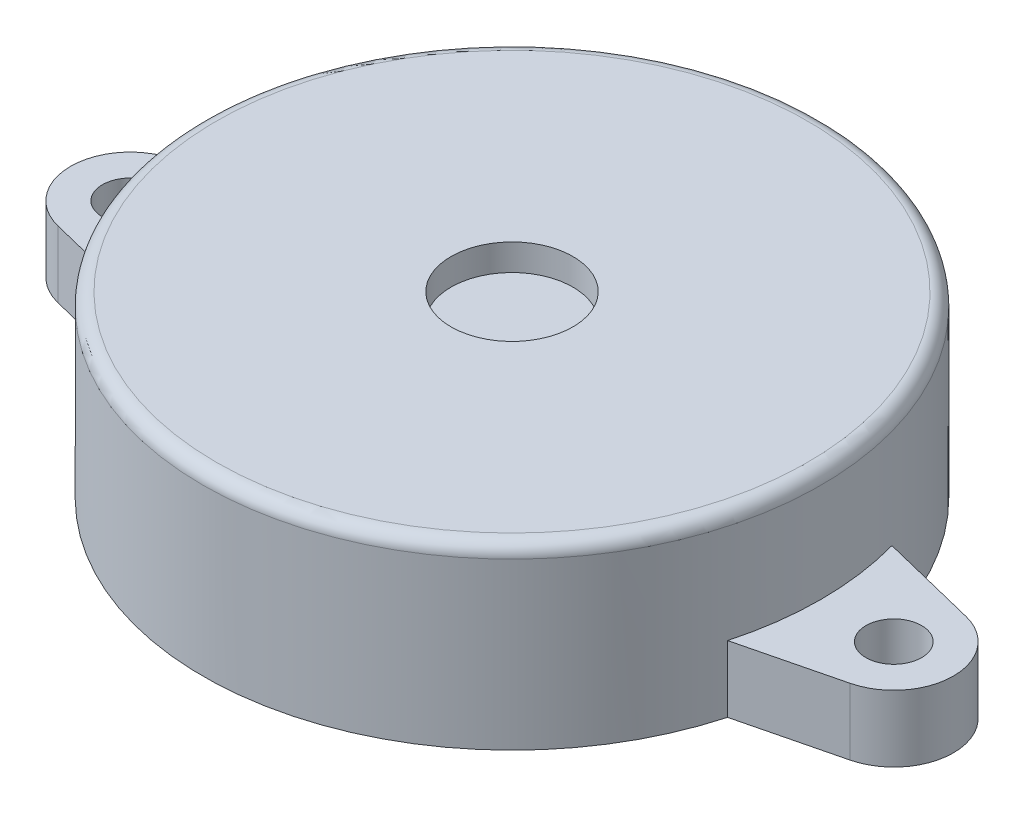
ISO-10303-21;
HEADER;
FILE_DESCRIPTION(('STEP AP214'),'2;1');
FILE_NAME('part.step','',(''),(''),'','','');
FILE_SCHEMA(('AUTOMOTIVE_DESIGN { 1 0 10303 214 1 1 1 1 }'));
ENDSEC;
DATA;
#1=APPLICATION_CONTEXT('core data for automotive mechanical design processes');
#2=APPLICATION_PROTOCOL_DEFINITION('international standard','automotive_design',2000,#1);
#3=PRODUCT_CONTEXT('',#1,'mechanical');
#4=PRODUCT('Part','Part','',(#3));
#5=PRODUCT_RELATED_PRODUCT_CATEGORY('part','',(#4));
#6=PRODUCT_DEFINITION_FORMATION('','',#4);
#7=PRODUCT_DEFINITION_CONTEXT('part definition',#1,'design');
#8=PRODUCT_DEFINITION('design','',#6,#7);
#9=PRODUCT_DEFINITION_SHAPE('','',#8);
#10=(LENGTH_UNIT() NAMED_UNIT(*) SI_UNIT(.MILLI.,.METRE.));
#11=(NAMED_UNIT(*) PLANE_ANGLE_UNIT() SI_UNIT($,.RADIAN.));
#12=(NAMED_UNIT(*) SI_UNIT($,.STERADIAN.) SOLID_ANGLE_UNIT());
#13=UNCERTAINTY_MEASURE_WITH_UNIT(LENGTH_MEASURE(1.E-05),#10,'distance_accuracy_value','');
#14=(GEOMETRIC_REPRESENTATION_CONTEXT(3) GLOBAL_UNCERTAINTY_ASSIGNED_CONTEXT((#13)) GLOBAL_UNIT_ASSIGNED_CONTEXT((#10,
#11,#12)) REPRESENTATION_CONTEXT('',''));
#15=CARTESIAN_POINT('',(0.,0.,0.));
#16=DIRECTION('',(0.,0.,1.));
#17=DIRECTION('',(1.,0.,0.));
#18=AXIS2_PLACEMENT_3D('',#15,#16,#17);
#19=CARTESIAN_POINT('',(0.,4.23,0.));
#20=DIRECTION('',(0.,-1.,0.));
#21=DIRECTION('',(0.,0.,-1.));
#22=AXIS2_PLACEMENT_3D('',#19,#20,#21);
#23=CYLINDRICAL_SURFACE('',#22,11.65);
#24=CARTESIAN_POINT('',(0.,3.73,0.));
#25=DIRECTION('',(0.,1.,0.));
#26=DIRECTION('',(0.,0.,1.));
#27=AXIS2_PLACEMENT_3D('',#24,#25,#26);
#28=CIRCLE('',#27,11.65);
#29=CARTESIAN_POINT('',(0.,3.73,11.65));
#30=VERTEX_POINT('',#29);
#31=EDGE_CURVE('E11',#30,#30,#28,.F.);
#32=ORIENTED_EDGE('',*,*,#31,.T.);
#33=EDGE_LOOP('',(#32));
#34=FACE_BOUND('',#33,.T.);
#35=CARTESIAN_POINT('',(0.,0.,0.));
#36=DIRECTION('',(0.,1.,0.));
#37=DIRECTION('',(0.,0.,1.));
#38=AXIS2_PLACEMENT_3D('',#35,#36,#37);
#39=CIRCLE('',#38,11.65);
#40=CARTESIAN_POINT('',(11.2299821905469,0.,3.1));
#41=VERTEX_POINT('',#40);
#42=CARTESIAN_POINT('',(11.2299821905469,0.,-3.1));
#43=VERTEX_POINT('',#42);
#44=EDGE_CURVE('E153',#41,#43,#39,.T.);
#45=ORIENTED_EDGE('',*,*,#44,.T.);
#46=DIRECTION('',(0.,1.,0.));
#47=VECTOR('',#46,1.);
#48=CARTESIAN_POINT('',(11.2299821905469,-2.51,-3.1));
#49=LINE('',#48,#47);
#50=CARTESIAN_POINT('',(11.2299821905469,-2.51,-3.1));
#51=VERTEX_POINT('',#50);
#52=EDGE_CURVE('E152',#51,#43,#49,.T.);
#53=ORIENTED_EDGE('',*,*,#52,.F.);
#54=CARTESIAN_POINT('',(0.,-2.51,0.));
#55=DIRECTION('',(0.,-1.,0.));
#56=DIRECTION('',(0.,0.,-1.));
#57=AXIS2_PLACEMENT_3D('',#54,#55,#56);
#58=CIRCLE('',#57,11.65);
#59=CARTESIAN_POINT('',(-11.2299821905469,-2.51,-3.1));
#60=VERTEX_POINT('',#59);
#61=EDGE_CURVE('E172',#60,#51,#58,.T.);
#62=ORIENTED_EDGE('',*,*,#61,.F.);
#63=DIRECTION('',(0.,1.,0.));
#64=VECTOR('',#63,1.);
#65=CARTESIAN_POINT('',(-11.2299821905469,-2.51,-3.1));
#66=LINE('',#65,#64);
#67=CARTESIAN_POINT('',(-11.2299821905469,0.,-3.1));
#68=VERTEX_POINT('',#67);
#69=EDGE_CURVE('E134',#60,#68,#66,.T.);
#70=ORIENTED_EDGE('',*,*,#69,.T.);
#71=CARTESIAN_POINT('',(-11.2299821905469,0.,3.1));
#72=VERTEX_POINT('',#71);
#73=EDGE_CURVE('E89',#68,#72,#39,.T.);
#74=ORIENTED_EDGE('',*,*,#73,.T.);
#75=DIRECTION('',(0.,1.,0.));
#76=VECTOR('',#75,1.);
#77=CARTESIAN_POINT('',(-11.2299821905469,-2.51,3.1));
#78=LINE('',#77,#76);
#79=CARTESIAN_POINT('',(-11.2299821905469,-2.51,3.1));
#80=VERTEX_POINT('',#79);
#81=EDGE_CURVE('E128',#80,#72,#78,.T.);
#82=ORIENTED_EDGE('',*,*,#81,.F.);
#83=CARTESIAN_POINT('',(0.,-2.51,0.));
#84=DIRECTION('',(0.,-1.,0.));
#85=DIRECTION('',(0.,0.,-1.));
#86=AXIS2_PLACEMENT_3D('',#83,#84,#85);
#87=CIRCLE('',#86,11.65);
#88=CARTESIAN_POINT('',(11.2299821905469,-2.51,3.1));
#89=VERTEX_POINT('',#88);
#90=EDGE_CURVE('E118',#89,#80,#87,.T.);
#91=ORIENTED_EDGE('',*,*,#90,.F.);
#92=DIRECTION('',(0.,1.,0.));
#93=VECTOR('',#92,1.);
#94=CARTESIAN_POINT('',(11.2299821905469,-2.51,3.1));
#95=LINE('',#94,#93);
#96=EDGE_CURVE('E50',#89,#41,#95,.T.);
#97=ORIENTED_EDGE('',*,*,#96,.T.);
#98=EDGE_LOOP('',(#45,#53,#62,#70,#74,#82,#91,#97));
#99=FACE_BOUND('',#98,.T.);
#100=ADVANCED_FACE('F35',(#34,#99),#23,.T.);
#101=CARTESIAN_POINT('',(0.,4.23,0.));
#102=DIRECTION('',(0.,1.,0.));
#103=DIRECTION('',(0.,0.,1.));
#104=AXIS2_PLACEMENT_3D('',#101,#102,#103);
#105=PLANE('',#104);
#106=CARTESIAN_POINT('',(0.,4.23,0.));
#107=DIRECTION('',(0.,1.,0.));
#108=DIRECTION('',(0.,0.,1.));
#109=AXIS2_PLACEMENT_3D('',#106,#107,#108);
#110=CIRCLE('',#109,11.15);
#111=CARTESIAN_POINT('',(0.,4.23,11.15));
#112=VERTEX_POINT('',#111);
#113=EDGE_CURVE('E43',#112,#112,#110,.T.);
#114=ORIENTED_EDGE('',*,*,#113,.T.);
#115=EDGE_LOOP('',(#114));
#116=FACE_BOUND('',#115,.T.);
#117=CARTESIAN_POINT('',(0.,4.23,0.));
#118=DIRECTION('',(0.,1.,0.));
#119=DIRECTION('',(0.,0.,1.));
#120=AXIS2_PLACEMENT_3D('',#117,#118,#119);
#121=CIRCLE('',#120,2.3);
#122=CARTESIAN_POINT('',(0.,4.23,2.3));
#123=VERTEX_POINT('',#122);
#124=EDGE_CURVE('E252',#123,#123,#121,.T.);
#125=ORIENTED_EDGE('',*,*,#124,.F.);
#126=EDGE_LOOP('',(#125));
#127=FACE_BOUND('',#126,.T.);
#128=ADVANCED_FACE('F188',(#116,#127),#105,.T.);
#129=CARTESIAN_POINT('',(0.,0.,0.));
#130=DIRECTION('',(0.,-1.,0.));
#131=DIRECTION('',(0.,0.,-1.));
#132=AXIS2_PLACEMENT_3D('',#129,#130,#131);
#133=PLANE('',#132);
#134=ORIENTED_EDGE('',*,*,#44,.F.);
#135=DIRECTION('',(-0.970861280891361,0.,0.239642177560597));
#136=VECTOR('',#135,1.);
#137=CARTESIAN_POINT('',(11.2299821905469,0.,3.1));
#138=LINE('',#137,#136);
#139=CARTESIAN_POINT('',(14.9391948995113,0.,2.18443788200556));
#140=VERTEX_POINT('',#139);
#141=EDGE_CURVE('E140',#140,#41,#138,.T.);
#142=ORIENTED_EDGE('',*,*,#141,.F.);
#143=CARTESIAN_POINT('',(14.4,0.,0.));
#144=DIRECTION('',(0.,-1.,0.));
#145=DIRECTION('',(0.,0.,-1.));
#146=AXIS2_PLACEMENT_3D('',#143,#144,#145);
#147=CIRCLE('',#146,2.25);
#148=CARTESIAN_POINT('',(14.9391948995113,0.,-2.18443788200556));
#149=VERTEX_POINT('',#148);
#150=EDGE_CURVE('E138',#149,#140,#147,.T.);
#151=ORIENTED_EDGE('',*,*,#150,.F.);
#152=DIRECTION('',(0.970861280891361,0.,0.239642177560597));
#153=VECTOR('',#152,1.);
#154=CARTESIAN_POINT('',(11.2299821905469,0.,-3.1));
#155=LINE('',#154,#153);
#156=EDGE_CURVE('E141',#43,#149,#155,.T.);
#157=ORIENTED_EDGE('',*,*,#156,.F.);
#158=EDGE_LOOP('',(#134,#142,#151,#157));
#159=FACE_BOUND('',#158,.T.);
#160=CARTESIAN_POINT('',(14.4,0.,0.));
#161=DIRECTION('',(0.,-1.,0.));
#162=DIRECTION('',(0.,0.,-1.));
#163=AXIS2_PLACEMENT_3D('',#160,#161,#162);
#164=CIRCLE('',#163,1.05);
#165=CARTESIAN_POINT('',(14.4,0.,-1.05));
#166=VERTEX_POINT('',#165);
#167=EDGE_CURVE('E260',#166,#166,#164,.T.);
#168=ORIENTED_EDGE('',*,*,#167,.T.);
#169=EDGE_LOOP('',(#168));
#170=FACE_BOUND('',#169,.T.);
#171=ADVANCED_FACE('F206',(#159,#170),#133,.F.);
#172=CARTESIAN_POINT('',(0.,-2.51,0.));
#173=DIRECTION('',(0.,-1.,0.));
#174=DIRECTION('',(0.,0.,-1.));
#175=AXIS2_PLACEMENT_3D('',#172,#173,#174);
#176=PLANE('',#175);
#177=CARTESIAN_POINT('',(14.4,-2.51,0.));
#178=DIRECTION('',(0.,-1.,0.));
#179=DIRECTION('',(0.,0.,-1.));
#180=AXIS2_PLACEMENT_3D('',#177,#178,#179);
#181=CIRCLE('',#180,1.05);
#182=CARTESIAN_POINT('',(14.4,-2.51,-1.05));
#183=VERTEX_POINT('',#182);
#184=EDGE_CURVE('E180',#183,#183,#181,.T.);
#185=ORIENTED_EDGE('',*,*,#184,.F.);
#186=EDGE_LOOP('',(#185));
#187=FACE_BOUND('',#186,.T.);
#188=ORIENTED_EDGE('',*,*,#61,.T.);
#189=DIRECTION('',(0.970861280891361,0.,0.239642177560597));
#190=VECTOR('',#189,1.);
#191=CARTESIAN_POINT('',(11.2299821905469,-2.51,-3.1));
#192=LINE('',#191,#190);
#193=CARTESIAN_POINT('',(14.9391948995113,-2.51,-2.18443788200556));
#194=VERTEX_POINT('',#193);
#195=EDGE_CURVE('E98',#51,#194,#192,.T.);
#196=ORIENTED_EDGE('',*,*,#195,.T.);
#197=CARTESIAN_POINT('',(14.4,-2.51,0.));
#198=DIRECTION('',(0.,-1.,0.));
#199=DIRECTION('',(0.,0.,-1.));
#200=AXIS2_PLACEMENT_3D('',#197,#198,#199);
#201=CIRCLE('',#200,2.25);
#202=CARTESIAN_POINT('',(14.9391948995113,-2.51,2.18443788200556));
#203=VERTEX_POINT('',#202);
#204=EDGE_CURVE('E269',#194,#203,#201,.T.);
#205=ORIENTED_EDGE('',*,*,#204,.T.);
#206=DIRECTION('',(-0.970861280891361,0.,0.239642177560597));
#207=VECTOR('',#206,1.);
#208=CARTESIAN_POINT('',(11.2299821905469,-2.51,3.1));
#209=LINE('',#208,#207);
#210=EDGE_CURVE('E271',#203,#89,#209,.T.);
#211=ORIENTED_EDGE('',*,*,#210,.T.);
#212=ORIENTED_EDGE('',*,*,#90,.T.);
#213=DIRECTION('',(-0.970861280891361,0.,-0.239642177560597));
#214=VECTOR('',#213,1.);
#215=CARTESIAN_POINT('',(-11.2299821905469,-2.51,3.1));
#216=LINE('',#215,#214);
#217=CARTESIAN_POINT('',(-14.9391948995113,-2.51,2.18443788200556));
#218=VERTEX_POINT('',#217);
#219=EDGE_CURVE('E111',#80,#218,#216,.T.);
#220=ORIENTED_EDGE('',*,*,#219,.T.);
#221=CARTESIAN_POINT('',(-14.4,-2.51,0.));
#222=DIRECTION('',(0.,-1.,0.));
#223=DIRECTION('',(0.,0.,1.));
#224=AXIS2_PLACEMENT_3D('',#221,#222,#223);
#225=CIRCLE('',#224,2.25);
#226=CARTESIAN_POINT('',(-14.9391948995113,-2.51,-2.18443788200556));
#227=VERTEX_POINT('',#226);
#228=EDGE_CURVE('E116',#218,#227,#225,.T.);
#229=ORIENTED_EDGE('',*,*,#228,.T.);
#230=DIRECTION('',(0.970861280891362,0.,-0.239642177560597));
#231=VECTOR('',#230,1.);
#232=CARTESIAN_POINT('',(-11.2299821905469,-2.51,-3.1));
#233=LINE('',#232,#231);
#234=EDGE_CURVE('E59',#227,#60,#233,.T.);
#235=ORIENTED_EDGE('',*,*,#234,.T.);
#236=EDGE_LOOP('',(#188,#196,#205,#211,#212,#220,#229,#235));
#237=FACE_BOUND('',#236,.T.);
#238=CARTESIAN_POINT('',(-14.4,-2.51,0.));
#239=DIRECTION('',(0.,-1.,0.));
#240=DIRECTION('',(0.,0.,1.));
#241=AXIS2_PLACEMENT_3D('',#238,#239,#240);
#242=CIRCLE('',#241,1.05);
#243=CARTESIAN_POINT('',(-14.4,-2.51,1.05));
#244=VERTEX_POINT('',#243);
#245=EDGE_CURVE('E257',#244,#244,#242,.T.);
#246=ORIENTED_EDGE('',*,*,#245,.F.);
#247=EDGE_LOOP('',(#246));
#248=FACE_BOUND('',#247,.T.);
#249=ADVANCED_FACE('F113',(#187,#237,#248),#176,.T.);
#250=ORIENTED_EDGE('',*,*,#73,.F.);
#251=DIRECTION('',(0.970861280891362,0.,-0.239642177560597));
#252=VECTOR('',#251,1.);
#253=CARTESIAN_POINT('',(-11.2299821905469,0.,-3.1));
#254=LINE('',#253,#252);
#255=CARTESIAN_POINT('',(-14.9391948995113,0.,-2.18443788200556));
#256=VERTEX_POINT('',#255);
#257=EDGE_CURVE('E144',#256,#68,#254,.T.);
#258=ORIENTED_EDGE('',*,*,#257,.F.);
#259=CARTESIAN_POINT('',(-14.4,0.,0.));
#260=DIRECTION('',(0.,-1.,0.));
#261=DIRECTION('',(0.,0.,1.));
#262=AXIS2_PLACEMENT_3D('',#259,#260,#261);
#263=CIRCLE('',#262,2.25);
#264=CARTESIAN_POINT('',(-14.9391948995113,0.,2.18443788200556));
#265=VERTEX_POINT('',#264);
#266=EDGE_CURVE('E142',#265,#256,#263,.T.);
#267=ORIENTED_EDGE('',*,*,#266,.F.);
#268=DIRECTION('',(-0.970861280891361,0.,-0.239642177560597));
#269=VECTOR('',#268,1.);
#270=CARTESIAN_POINT('',(-11.2299821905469,0.,3.1));
#271=LINE('',#270,#269);
#272=EDGE_CURVE('E125',#72,#265,#271,.T.);
#273=ORIENTED_EDGE('',*,*,#272,.F.);
#274=EDGE_LOOP('',(#250,#258,#267,#273));
#275=FACE_BOUND('',#274,.T.);
#276=CARTESIAN_POINT('',(-14.4,0.,0.));
#277=DIRECTION('',(0.,-1.,0.));
#278=DIRECTION('',(0.,0.,1.));
#279=AXIS2_PLACEMENT_3D('',#276,#277,#278);
#280=CIRCLE('',#279,1.05);
#281=CARTESIAN_POINT('',(-14.4,0.,1.05));
#282=VERTEX_POINT('',#281);
#283=EDGE_CURVE('E254',#282,#282,#280,.T.);
#284=ORIENTED_EDGE('',*,*,#283,.T.);
#285=EDGE_LOOP('',(#284));
#286=FACE_BOUND('',#285,.T.);
#287=ADVANCED_FACE('F213',(#275,#286),#133,.F.);
#288=CARTESIAN_POINT('',(11.2299821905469,-2.51,-3.1));
#289=DIRECTION('',(-0.239642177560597,0.,0.970861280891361));
#290=DIRECTION('',(0.970861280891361,0.,0.239642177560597));
#291=AXIS2_PLACEMENT_3D('',#288,#289,#290);
#292=PLANE('',#291);
#293=ORIENTED_EDGE('',*,*,#156,.T.);
#294=DIRECTION('',(0.,1.,0.));
#295=VECTOR('',#294,1.);
#296=CARTESIAN_POINT('',(14.9391948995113,-2.51,-2.18443788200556));
#297=LINE('',#296,#295);
#298=EDGE_CURVE('E149',#194,#149,#297,.T.);
#299=ORIENTED_EDGE('',*,*,#298,.F.);
#300=ORIENTED_EDGE('',*,*,#195,.F.);
#301=ORIENTED_EDGE('',*,*,#52,.T.);
#302=EDGE_LOOP('',(#293,#299,#300,#301));
#303=FACE_BOUND('',#302,.T.);
#304=ADVANCED_FACE('F209',(#303),#292,.F.);
#305=CARTESIAN_POINT('',(14.4,-2.51,0.));
#306=DIRECTION('',(0.,1.,0.));
#307=DIRECTION('',(0.,0.,1.));
#308=AXIS2_PLACEMENT_3D('',#305,#306,#307);
#309=CYLINDRICAL_SURFACE('',#308,2.25);
#310=ORIENTED_EDGE('',*,*,#150,.T.);
#311=DIRECTION('',(0.,1.,0.));
#312=VECTOR('',#311,1.);
#313=CARTESIAN_POINT('',(14.9391948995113,-2.51,2.18443788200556));
#314=LINE('',#313,#312);
#315=EDGE_CURVE('E146',#203,#140,#314,.T.);
#316=ORIENTED_EDGE('',*,*,#315,.F.);
#317=ORIENTED_EDGE('',*,*,#204,.F.);
#318=ORIENTED_EDGE('',*,*,#298,.T.);
#319=EDGE_LOOP('',(#310,#316,#317,#318));
#320=FACE_BOUND('',#319,.T.);
#321=ADVANCED_FACE('F212',(#320),#309,.T.);
#322=CARTESIAN_POINT('',(11.2299821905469,-2.51,3.1));
#323=DIRECTION('',(-0.239642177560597,0.,-0.970861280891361));
#324=DIRECTION('',(-0.970861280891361,0.,0.239642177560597));
#325=AXIS2_PLACEMENT_3D('',#322,#323,#324);
#326=PLANE('',#325);
#327=ORIENTED_EDGE('',*,*,#141,.T.);
#328=ORIENTED_EDGE('',*,*,#96,.F.);
#329=ORIENTED_EDGE('',*,*,#210,.F.);
#330=ORIENTED_EDGE('',*,*,#315,.T.);
#331=EDGE_LOOP('',(#327,#328,#329,#330));
#332=FACE_BOUND('',#331,.T.);
#333=ADVANCED_FACE('F216',(#332),#326,.F.);
#334=CARTESIAN_POINT('',(-11.2299821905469,-2.51,3.1));
#335=DIRECTION('',(0.239642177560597,0.,-0.970861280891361));
#336=DIRECTION('',(-0.970861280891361,0.,-0.239642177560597));
#337=AXIS2_PLACEMENT_3D('',#334,#335,#336);
#338=PLANE('',#337);
#339=ORIENTED_EDGE('',*,*,#272,.T.);
#340=DIRECTION('',(0.,1.,0.));
#341=VECTOR('',#340,1.);
#342=CARTESIAN_POINT('',(-14.9391948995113,-2.51,2.18443788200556));
#343=LINE('',#342,#341);
#344=EDGE_CURVE('E123',#218,#265,#343,.T.);
#345=ORIENTED_EDGE('',*,*,#344,.F.);
#346=ORIENTED_EDGE('',*,*,#219,.F.);
#347=ORIENTED_EDGE('',*,*,#81,.T.);
#348=EDGE_LOOP('',(#339,#345,#346,#347));
#349=FACE_BOUND('',#348,.T.);
#350=ADVANCED_FACE('F124',(#349),#338,.F.);
#351=CARTESIAN_POINT('',(-14.4,-2.51,0.));
#352=DIRECTION('',(0.,1.,0.));
#353=DIRECTION('',(0.,0.,1.));
#354=AXIS2_PLACEMENT_3D('',#351,#352,#353);
#355=CYLINDRICAL_SURFACE('',#354,2.25);
#356=ORIENTED_EDGE('',*,*,#266,.T.);
#357=DIRECTION('',(0.,1.,0.));
#358=VECTOR('',#357,1.);
#359=CARTESIAN_POINT('',(-14.9391948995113,-2.51,-2.18443788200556));
#360=LINE('',#359,#358);
#361=EDGE_CURVE('E129',#227,#256,#360,.T.);
#362=ORIENTED_EDGE('',*,*,#361,.F.);
#363=ORIENTED_EDGE('',*,*,#228,.F.);
#364=ORIENTED_EDGE('',*,*,#344,.T.);
#365=EDGE_LOOP('',(#356,#362,#363,#364));
#366=FACE_BOUND('',#365,.T.);
#367=ADVANCED_FACE('F131',(#366),#355,.T.);
#368=CARTESIAN_POINT('',(-11.2299821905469,-2.51,-3.1));
#369=DIRECTION('',(0.239642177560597,0.,0.970861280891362));
#370=DIRECTION('',(0.970861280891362,0.,-0.239642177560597));
#371=AXIS2_PLACEMENT_3D('',#368,#369,#370);
#372=PLANE('',#371);
#373=ORIENTED_EDGE('',*,*,#257,.T.);
#374=ORIENTED_EDGE('',*,*,#69,.F.);
#375=ORIENTED_EDGE('',*,*,#234,.F.);
#376=ORIENTED_EDGE('',*,*,#361,.T.);
#377=EDGE_LOOP('',(#373,#374,#375,#376));
#378=FACE_BOUND('',#377,.T.);
#379=ADVANCED_FACE('F225',(#378),#372,.F.);
#380=CARTESIAN_POINT('',(14.4,-2.51,0.));
#381=DIRECTION('',(0.,1.,0.));
#382=DIRECTION('',(0.,0.,1.));
#383=AXIS2_PLACEMENT_3D('',#380,#381,#382);
#384=CYLINDRICAL_SURFACE('',#383,1.05);
#385=ORIENTED_EDGE('',*,*,#184,.T.);
#386=EDGE_LOOP('',(#385));
#387=FACE_BOUND('',#386,.T.);
#388=ORIENTED_EDGE('',*,*,#167,.F.);
#389=EDGE_LOOP('',(#388));
#390=FACE_BOUND('',#389,.T.);
#391=ADVANCED_FACE('F228',(#387,#390),#384,.F.);
#392=CARTESIAN_POINT('',(-14.4,-2.51,0.));
#393=DIRECTION('',(0.,1.,0.));
#394=DIRECTION('',(0.,0.,1.));
#395=AXIS2_PLACEMENT_3D('',#392,#393,#394);
#396=CYLINDRICAL_SURFACE('',#395,1.05);
#397=ORIENTED_EDGE('',*,*,#245,.T.);
#398=EDGE_LOOP('',(#397));
#399=FACE_BOUND('',#398,.T.);
#400=ORIENTED_EDGE('',*,*,#283,.F.);
#401=EDGE_LOOP('',(#400));
#402=FACE_BOUND('',#401,.T.);
#403=ADVANCED_FACE('F237',(#399,#402),#396,.F.);
#404=CARTESIAN_POINT('',(0.,3.23,0.));
#405=DIRECTION('',(0.,1.,0.));
#406=DIRECTION('',(0.,0.,1.));
#407=AXIS2_PLACEMENT_3D('',#404,#405,#406);
#408=CYLINDRICAL_SURFACE('',#407,2.3);
#409=CARTESIAN_POINT('',(0.,3.23,0.));
#410=DIRECTION('',(0.,1.,0.));
#411=DIRECTION('',(0.,0.,1.));
#412=AXIS2_PLACEMENT_3D('',#409,#410,#411);
#413=CIRCLE('',#412,2.3);
#414=CARTESIAN_POINT('',(0.,3.23,2.3));
#415=VERTEX_POINT('',#414);
#416=EDGE_CURVE('E249',#415,#415,#413,.T.);
#417=ORIENTED_EDGE('',*,*,#416,.F.);
#418=EDGE_LOOP('',(#417));
#419=FACE_BOUND('',#418,.T.);
#420=ORIENTED_EDGE('',*,*,#124,.T.);
#421=EDGE_LOOP('',(#420));
#422=FACE_BOUND('',#421,.T.);
#423=ADVANCED_FACE('F197',(#419,#422),#408,.F.);
#424=CARTESIAN_POINT('',(0.,3.23,0.));
#425=DIRECTION('',(0.,1.,0.));
#426=DIRECTION('',(0.,0.,1.));
#427=AXIS2_PLACEMENT_3D('',#424,#425,#426);
#428=PLANE('',#427);
#429=ORIENTED_EDGE('',*,*,#416,.T.);
#430=EDGE_LOOP('',(#429));
#431=FACE_BOUND('',#430,.T.);
#432=ADVANCED_FACE('F192',(#431),#428,.T.);
#433=CARTESIAN_POINT('',(0.,3.73,0.));
#434=DIRECTION('',(0.,1.,0.));
#435=DIRECTION('',(0.,0.,1.));
#436=AXIS2_PLACEMENT_3D('',#433,#434,#435);
#437=TOROIDAL_SURFACE('',#436,11.15,0.5);
#438=ORIENTED_EDGE('',*,*,#31,.F.);
#439=EDGE_LOOP('',(#438));
#440=FACE_BOUND('',#439,.T.);
#441=ORIENTED_EDGE('',*,*,#113,.F.);
#442=EDGE_LOOP('',(#441));
#443=FACE_BOUND('',#442,.T.);
#444=ADVANCED_FACE('F37',(#440,#443),#437,.T.);
#445=CLOSED_SHELL('',(#100,#128,#171,#249,#287,#304,#321,#333,#350,#367,#379,#391,#403,#423,
#432,#444));
#446=MANIFOLD_SOLID_BREP('B2',#445);
#447=ADVANCED_BREP_SHAPE_REPRESENTATION('',(#18,#446),#14);
#448=SHAPE_DEFINITION_REPRESENTATION(#9,#447);
ENDSEC;
END-ISO-10303-21;
